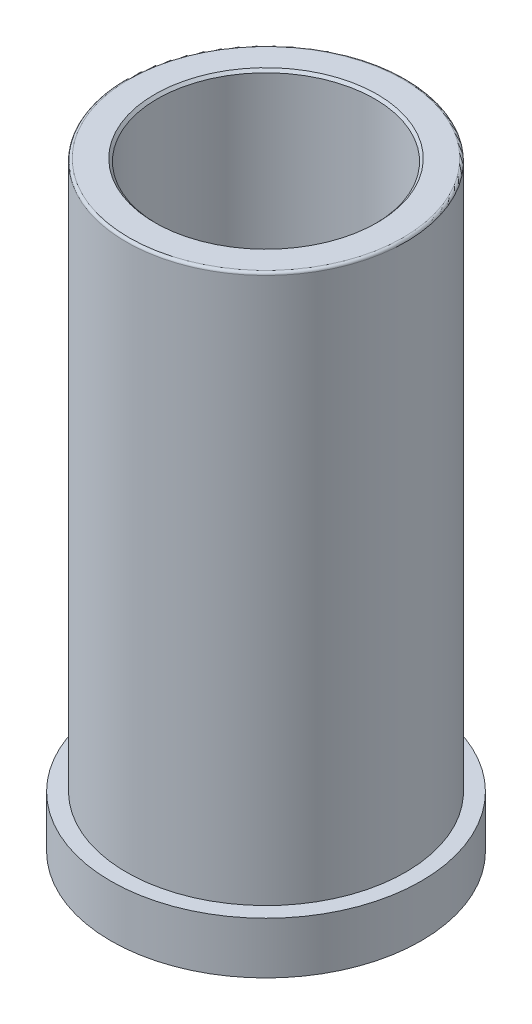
ISO-10303-21;
HEADER;
FILE_DESCRIPTION(('STEP AP214'),'2;1');
FILE_NAME('part.step','',(''),(''),'','','');
FILE_SCHEMA(('AUTOMOTIVE_DESIGN { 1 0 10303 214 1 1 1 1 }'));
ENDSEC;
DATA;
#1=APPLICATION_CONTEXT('core data for automotive mechanical design processes');
#2=APPLICATION_PROTOCOL_DEFINITION('international standard','automotive_design',2000,#1);
#3=PRODUCT_CONTEXT('',#1,'mechanical');
#4=PRODUCT('Part','Part','',(#3));
#5=PRODUCT_RELATED_PRODUCT_CATEGORY('part','',(#4));
#6=PRODUCT_DEFINITION_FORMATION('','',#4);
#7=PRODUCT_DEFINITION_CONTEXT('part definition',#1,'design');
#8=PRODUCT_DEFINITION('design','',#6,#7);
#9=PRODUCT_DEFINITION_SHAPE('','',#8);
#10=(LENGTH_UNIT() NAMED_UNIT(*) SI_UNIT(.MILLI.,.METRE.));
#11=(NAMED_UNIT(*) PLANE_ANGLE_UNIT() SI_UNIT($,.RADIAN.));
#12=(NAMED_UNIT(*) SI_UNIT($,.STERADIAN.) SOLID_ANGLE_UNIT());
#13=UNCERTAINTY_MEASURE_WITH_UNIT(LENGTH_MEASURE(1.E-05),#10,'distance_accuracy_value','');
#14=(GEOMETRIC_REPRESENTATION_CONTEXT(3) GLOBAL_UNCERTAINTY_ASSIGNED_CONTEXT((#13)) GLOBAL_UNIT_ASSIGNED_CONTEXT((#10,
#11,#12)) REPRESENTATION_CONTEXT('',''));
#15=CARTESIAN_POINT('',(0.,0.,0.));
#16=DIRECTION('',(0.,0.,1.));
#17=DIRECTION('',(1.,0.,0.));
#18=AXIS2_PLACEMENT_3D('',#15,#16,#17);
#19=CARTESIAN_POINT('',(0.,0.,0.));
#20=DIRECTION('',(0.,-1.,0.));
#21=DIRECTION('',(0.,0.,-1.));
#22=AXIS2_PLACEMENT_3D('',#19,#20,#21);
#23=CYLINDRICAL_SURFACE('',#22,27.);
#24=CARTESIAN_POINT('',(0.,105.5,0.));
#25=DIRECTION('',(0.,-1.,0.));
#26=DIRECTION('',(0.,0.,-1.));
#27=AXIS2_PLACEMENT_3D('',#24,#25,#26);
#28=CIRCLE('',#27,27.);
#29=CARTESIAN_POINT('',(0.,105.5,-27.));
#30=VERTEX_POINT('',#29);
#31=EDGE_CURVE('E21',#30,#30,#28,.T.);
#32=ORIENTED_EDGE('',*,*,#31,.T.);
#33=EDGE_LOOP('',(#32));
#34=FACE_BOUND('',#33,.T.);
#35=CARTESIAN_POINT('',(0.,0.,0.));
#36=DIRECTION('',(0.,-1.,0.));
#37=DIRECTION('',(0.,0.,-1.));
#38=AXIS2_PLACEMENT_3D('',#35,#36,#37);
#39=CIRCLE('',#38,27.);
#40=CARTESIAN_POINT('',(0.,0.,-27.));
#41=VERTEX_POINT('',#40);
#42=EDGE_CURVE('E49',#41,#41,#39,.T.);
#43=ORIENTED_EDGE('',*,*,#42,.F.);
#44=EDGE_LOOP('',(#43));
#45=FACE_BOUND('',#44,.T.);
#46=ADVANCED_FACE('F14',(#34,#45),#23,.T.);
#47=CARTESIAN_POINT('',(-27.,106.,0.));
#48=DIRECTION('',(0.,-1.,0.));
#49=DIRECTION('',(0.,0.,-1.));
#50=AXIS2_PLACEMENT_3D('',#47,#48,#49);
#51=PLANE('',#50);
#52=CARTESIAN_POINT('',(0.,106.,0.));
#53=DIRECTION('',(0.,-1.,0.));
#54=DIRECTION('',(0.,0.,-1.));
#55=AXIS2_PLACEMENT_3D('',#52,#53,#54);
#56=CIRCLE('',#55,26.5);
#57=CARTESIAN_POINT('',(0.,106.,-26.5));
#58=VERTEX_POINT('',#57);
#59=EDGE_CURVE('E9',#58,#58,#56,.F.);
#60=ORIENTED_EDGE('',*,*,#59,.T.);
#61=EDGE_LOOP('',(#60));
#62=FACE_BOUND('',#61,.T.);
#63=CARTESIAN_POINT('',(0.,106.,0.));
#64=DIRECTION('',(0.,-1.,0.));
#65=DIRECTION('',(0.,0.,-1.));
#66=AXIS2_PLACEMENT_3D('',#63,#64,#65);
#67=CIRCLE('',#66,21.5);
#68=CARTESIAN_POINT('',(0.,106.,-21.5));
#69=VERTEX_POINT('',#68);
#70=EDGE_CURVE('E37',#69,#69,#67,.T.);
#71=ORIENTED_EDGE('',*,*,#70,.T.);
#72=EDGE_LOOP('',(#71));
#73=FACE_BOUND('',#72,.T.);
#74=ADVANCED_FACE('F56',(#62,#73),#51,.F.);
#75=CARTESIAN_POINT('',(0.,0.,0.));
#76=DIRECTION('',(0.,-1.,0.));
#77=DIRECTION('',(0.,0.,-1.));
#78=AXIS2_PLACEMENT_3D('',#75,#76,#77);
#79=CYLINDRICAL_SURFACE('',#78,21.);
#80=CARTESIAN_POINT('',(0.,105.5,0.));
#81=DIRECTION('',(0.,-1.,0.));
#82=DIRECTION('',(0.,0.,-1.));
#83=AXIS2_PLACEMENT_3D('',#80,#81,#82);
#84=CIRCLE('',#83,21.);
#85=CARTESIAN_POINT('',(0.,105.5,-21.));
#86=VERTEX_POINT('',#85);
#87=EDGE_CURVE('E34',#86,#86,#84,.F.);
#88=ORIENTED_EDGE('',*,*,#87,.T.);
#89=EDGE_LOOP('',(#88));
#90=FACE_BOUND('',#89,.T.);
#91=CARTESIAN_POINT('',(0.,-10.,0.));
#92=DIRECTION('',(0.,-1.,0.));
#93=DIRECTION('',(0.,0.,-1.));
#94=AXIS2_PLACEMENT_3D('',#91,#92,#93);
#95=CIRCLE('',#94,21.);
#96=CARTESIAN_POINT('',(0.,-10.,-21.));
#97=VERTEX_POINT('',#96);
#98=EDGE_CURVE('E40',#97,#97,#95,.T.);
#99=ORIENTED_EDGE('',*,*,#98,.T.);
#100=EDGE_LOOP('',(#99));
#101=FACE_BOUND('',#100,.T.);
#102=ADVANCED_FACE('F63',(#90,#101),#79,.F.);
#103=CARTESIAN_POINT('',(0.,-10.15,0.));
#104=DIRECTION('',(0.,-1.,0.));
#105=DIRECTION('',(0.,0.,-1.));
#106=AXIS2_PLACEMENT_3D('',#103,#104,#105);
#107=CONICAL_SURFACE('',#106,21.1,0.588002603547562);
#108=CARTESIAN_POINT('',(0.,-10.36,0.));
#109=DIRECTION('',(0.,1.,0.));
#110=DIRECTION('',(0.,0.,1.));
#111=AXIS2_PLACEMENT_3D('',#108,#109,#110);
#112=CIRCLE('',#111,21.24);
#113=CARTESIAN_POINT('',(0.,-10.36,21.24));
#114=VERTEX_POINT('',#113);
#115=EDGE_CURVE('E25',#114,#114,#112,.F.);
#116=ORIENTED_EDGE('',*,*,#115,.T.);
#117=EDGE_LOOP('',(#116));
#118=FACE_BOUND('',#117,.T.);
#119=ORIENTED_EDGE('',*,*,#98,.F.);
#120=EDGE_LOOP('',(#119));
#121=FACE_BOUND('',#120,.T.);
#122=ADVANCED_FACE('F82',(#118,#121),#107,.F.);
#123=CARTESIAN_POINT('',(-21.1,-10.,0.));
#124=DIRECTION('',(0.,1.,0.));
#125=DIRECTION('',(0.,0.,1.));
#126=AXIS2_PLACEMENT_3D('',#123,#124,#125);
#127=PLANE('',#126);
#128=CARTESIAN_POINT('',(0.,-10.,0.));
#129=DIRECTION('',(0.,1.,0.));
#130=DIRECTION('',(0.,0.,1.));
#131=AXIS2_PLACEMENT_3D('',#128,#129,#130);
#132=CIRCLE('',#131,21.6);
#133=CARTESIAN_POINT('',(0.,-10.,21.6));
#134=VERTEX_POINT('',#133);
#135=EDGE_CURVE('E29',#134,#134,#132,.T.);
#136=ORIENTED_EDGE('',*,*,#135,.T.);
#137=EDGE_LOOP('',(#136));
#138=FACE_BOUND('',#137,.T.);
#139=CARTESIAN_POINT('',(0.,-10.,0.));
#140=DIRECTION('',(0.,-1.,0.));
#141=DIRECTION('',(0.,0.,-1.));
#142=AXIS2_PLACEMENT_3D('',#139,#140,#141);
#143=CIRCLE('',#142,30.);
#144=CARTESIAN_POINT('',(0.,-10.,-30.));
#145=VERTEX_POINT('',#144);
#146=EDGE_CURVE('E43',#145,#145,#143,.T.);
#147=ORIENTED_EDGE('',*,*,#146,.T.);
#148=EDGE_LOOP('',(#147));
#149=FACE_BOUND('',#148,.T.);
#150=ADVANCED_FACE('F85',(#138,#149),#127,.F.);
#151=CARTESIAN_POINT('',(0.,0.,0.));
#152=DIRECTION('',(0.,-1.,0.));
#153=DIRECTION('',(0.,0.,-1.));
#154=AXIS2_PLACEMENT_3D('',#151,#152,#153);
#155=CYLINDRICAL_SURFACE('',#154,30.);
#156=ORIENTED_EDGE('',*,*,#146,.F.);
#157=EDGE_LOOP('',(#156));
#158=FACE_BOUND('',#157,.T.);
#159=CARTESIAN_POINT('',(0.,0.,0.));
#160=DIRECTION('',(0.,-1.,0.));
#161=DIRECTION('',(0.,0.,-1.));
#162=AXIS2_PLACEMENT_3D('',#159,#160,#161);
#163=CIRCLE('',#162,30.);
#164=CARTESIAN_POINT('',(0.,0.,-30.));
#165=VERTEX_POINT('',#164);
#166=EDGE_CURVE('E46',#165,#165,#163,.T.);
#167=ORIENTED_EDGE('',*,*,#166,.T.);
#168=EDGE_LOOP('',(#167));
#169=FACE_BOUND('',#168,.T.);
#170=ADVANCED_FACE('F97',(#158,#169),#155,.T.);
#171=CARTESIAN_POINT('',(-30.,0.,0.));
#172=DIRECTION('',(0.,-1.,0.));
#173=DIRECTION('',(0.,0.,-1.));
#174=AXIS2_PLACEMENT_3D('',#171,#172,#173);
#175=PLANE('',#174);
#176=ORIENTED_EDGE('',*,*,#166,.F.);
#177=EDGE_LOOP('',(#176));
#178=FACE_BOUND('',#177,.T.);
#179=ORIENTED_EDGE('',*,*,#42,.T.);
#180=EDGE_LOOP('',(#179));
#181=FACE_BOUND('',#180,.T.);
#182=ADVANCED_FACE('F53',(#178,#181),#175,.F.);
#183=CARTESIAN_POINT('',(0.,106.,0.));
#184=DIRECTION('',(0.,1.,0.));
#185=DIRECTION('',(0.,0.,1.));
#186=AXIS2_PLACEMENT_3D('',#183,#184,#185);
#187=CONICAL_SURFACE('',#186,21.5,0.785398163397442);
#188=ORIENTED_EDGE('',*,*,#87,.F.);
#189=EDGE_LOOP('',(#188));
#190=FACE_BOUND('',#189,.T.);
#191=ORIENTED_EDGE('',*,*,#70,.F.);
#192=EDGE_LOOP('',(#191));
#193=FACE_BOUND('',#192,.T.);
#194=ADVANCED_FACE('F67',(#190,#193),#187,.F.);
#195=CARTESIAN_POINT('',(0.,-10.5,0.));
#196=DIRECTION('',(0.,1.,0.));
#197=DIRECTION('',(0.,0.,1.));
#198=AXIS2_PLACEMENT_3D('',#195,#196,#197);
#199=CONICAL_SURFACE('',#198,21.1,0.785398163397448);
#200=ORIENTED_EDGE('',*,*,#135,.F.);
#201=EDGE_LOOP('',(#200));
#202=FACE_BOUND('',#201,.T.);
#203=ORIENTED_EDGE('',*,*,#115,.F.);
#204=EDGE_LOOP('',(#203));
#205=FACE_BOUND('',#204,.T.);
#206=ADVANCED_FACE('F69',(#202,#205),#199,.T.);
#207=CARTESIAN_POINT('',(0.,105.5,0.));
#208=DIRECTION('',(0.,-1.,0.));
#209=DIRECTION('',(0.,0.,-1.));
#210=AXIS2_PLACEMENT_3D('',#207,#208,#209);
#211=TOROIDAL_SURFACE('',#210,26.5,0.5);
#212=ORIENTED_EDGE('',*,*,#59,.F.);
#213=EDGE_LOOP('',(#212));
#214=FACE_BOUND('',#213,.T.);
#215=ORIENTED_EDGE('',*,*,#31,.F.);
#216=EDGE_LOOP('',(#215));
#217=FACE_BOUND('',#216,.T.);
#218=ADVANCED_FACE('F16',(#214,#217),#211,.T.);
#219=CLOSED_SHELL('',(#46,#74,#102,#122,#150,#170,#182,#194,#206,#218));
#220=MANIFOLD_SOLID_BREP('B1',#219);
#221=ADVANCED_BREP_SHAPE_REPRESENTATION('',(#18,#220),#14);
#222=SHAPE_DEFINITION_REPRESENTATION(#9,#221);
ENDSEC;
END-ISO-10303-21;
